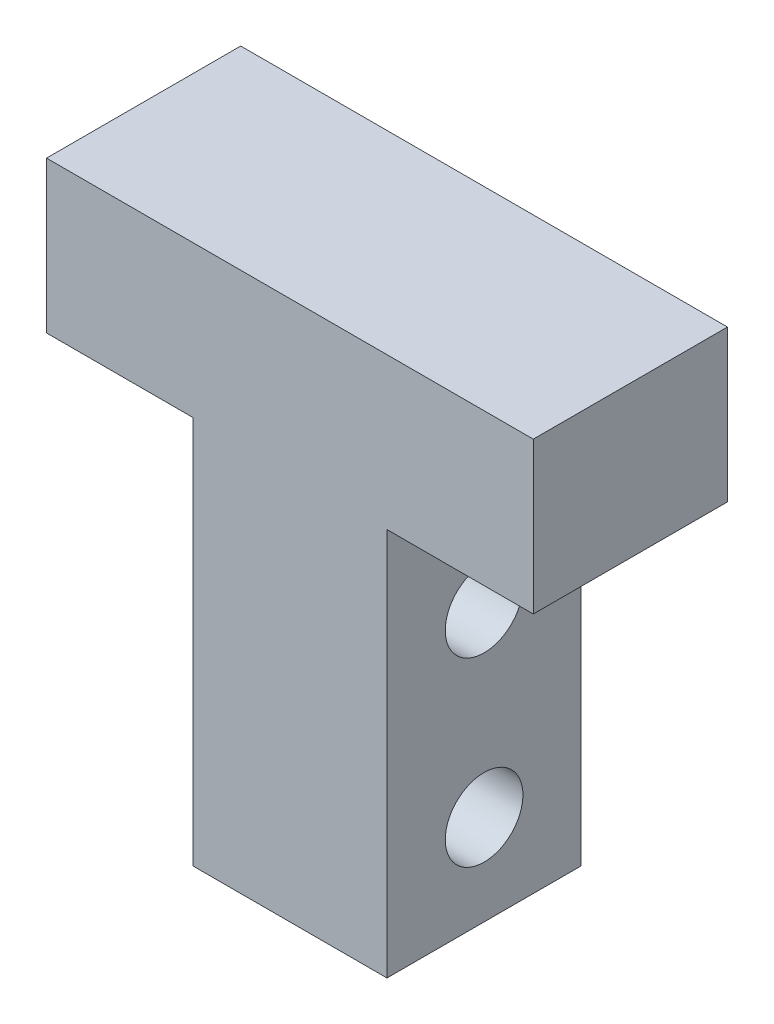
ISO-10303-21;
HEADER;
FILE_DESCRIPTION(('STEP AP214'),'2;1');
FILE_NAME('part.step','',(''),(''),'','','');
FILE_SCHEMA(('AUTOMOTIVE_DESIGN { 1 0 10303 214 1 1 1 1 }'));
ENDSEC;
DATA;
#1=APPLICATION_CONTEXT('core data for automotive mechanical design processes');
#2=APPLICATION_PROTOCOL_DEFINITION('international standard','automotive_design',2000,#1);
#3=PRODUCT_CONTEXT('',#1,'mechanical');
#4=PRODUCT('Part','Part','',(#3));
#5=PRODUCT_RELATED_PRODUCT_CATEGORY('part','',(#4));
#6=PRODUCT_DEFINITION_FORMATION('','',#4);
#7=PRODUCT_DEFINITION_CONTEXT('part definition',#1,'design');
#8=PRODUCT_DEFINITION('design','',#6,#7);
#9=PRODUCT_DEFINITION_SHAPE('','',#8);
#10=(LENGTH_UNIT() NAMED_UNIT(*) SI_UNIT(.MILLI.,.METRE.));
#11=(NAMED_UNIT(*) PLANE_ANGLE_UNIT() SI_UNIT($,.RADIAN.));
#12=(NAMED_UNIT(*) SI_UNIT($,.STERADIAN.) SOLID_ANGLE_UNIT());
#13=UNCERTAINTY_MEASURE_WITH_UNIT(LENGTH_MEASURE(1.E-05),#10,'distance_accuracy_value','');
#14=(GEOMETRIC_REPRESENTATION_CONTEXT(3) GLOBAL_UNCERTAINTY_ASSIGNED_CONTEXT((#13)) GLOBAL_UNIT_ASSIGNED_CONTEXT((#10,
#11,#12)) REPRESENTATION_CONTEXT('',''));
#15=CARTESIAN_POINT('',(0.,0.,0.));
#16=DIRECTION('',(0.,0.,1.));
#17=DIRECTION('',(1.,0.,0.));
#18=AXIS2_PLACEMENT_3D('',#15,#16,#17);
#19=CARTESIAN_POINT('',(-18.8,5.85,15.));
#20=DIRECTION('',(1.,0.,0.));
#21=DIRECTION('',(0.,0.,-1.));
#22=AXIS2_PLACEMENT_3D('',#19,#20,#21);
#23=PLANE('',#22);
#24=DIRECTION('',(0.,-1.,0.));
#25=VECTOR('',#24,1.);
#26=CARTESIAN_POINT('',(-18.8,5.85,0.));
#27=LINE('',#26,#25);
#28=CARTESIAN_POINT('',(-18.8,5.85,0.));
#29=VERTEX_POINT('',#28);
#30=CARTESIAN_POINT('',(-18.8,-5.85,0.));
#31=VERTEX_POINT('',#30);
#32=EDGE_CURVE('E140',#29,#31,#27,.T.);
#33=ORIENTED_EDGE('',*,*,#32,.T.);
#34=DIRECTION('',(0.,0.,-1.));
#35=VECTOR('',#34,1.);
#36=CARTESIAN_POINT('',(-18.8,-5.85,15.));
#37=LINE('',#36,#35);
#38=CARTESIAN_POINT('',(-18.8,-5.85,15.));
#39=VERTEX_POINT('',#38);
#40=EDGE_CURVE('E11',#39,#31,#37,.T.);
#41=ORIENTED_EDGE('',*,*,#40,.F.);
#42=DIRECTION('',(0.,-1.,0.));
#43=VECTOR('',#42,1.);
#44=CARTESIAN_POINT('',(-18.8,5.85,15.));
#45=LINE('',#44,#43);
#46=CARTESIAN_POINT('',(-18.8,5.85,15.));
#47=VERTEX_POINT('',#46);
#48=EDGE_CURVE('E155',#47,#39,#45,.T.);
#49=ORIENTED_EDGE('',*,*,#48,.F.);
#50=DIRECTION('',(0.,0.,-1.));
#51=VECTOR('',#50,1.);
#52=CARTESIAN_POINT('',(-18.8,5.85,15.));
#53=LINE('',#52,#51);
#54=EDGE_CURVE('E135',#47,#29,#53,.T.);
#55=ORIENTED_EDGE('',*,*,#54,.T.);
#56=EDGE_LOOP('',(#33,#41,#49,#55));
#57=FACE_BOUND('',#56,.T.);
#58=ADVANCED_FACE('F41',(#57),#23,.F.);
#59=CARTESIAN_POINT('',(-18.8,-5.85,15.));
#60=DIRECTION('',(0.,1.,0.));
#61=DIRECTION('',(0.,0.,1.));
#62=AXIS2_PLACEMENT_3D('',#59,#60,#61);
#63=PLANE('',#62);
#64=DIRECTION('',(1.,0.,0.));
#65=VECTOR('',#64,1.);
#66=CARTESIAN_POINT('',(-18.8,-5.85,0.));
#67=LINE('',#66,#65);
#68=CARTESIAN_POINT('',(-7.5,-5.85,0.));
#69=VERTEX_POINT('',#68);
#70=EDGE_CURVE('E136',#31,#69,#67,.T.);
#71=ORIENTED_EDGE('',*,*,#70,.T.);
#72=DIRECTION('',(0.,0.,-1.));
#73=VECTOR('',#72,1.);
#74=CARTESIAN_POINT('',(-7.5,-5.85,15.));
#75=LINE('',#74,#73);
#76=CARTESIAN_POINT('',(-7.5,-5.85,15.));
#77=VERTEX_POINT('',#76);
#78=EDGE_CURVE('E47',#77,#69,#75,.T.);
#79=ORIENTED_EDGE('',*,*,#78,.F.);
#80=DIRECTION('',(1.,0.,0.));
#81=VECTOR('',#80,1.);
#82=CARTESIAN_POINT('',(-18.8,-5.85,15.));
#83=LINE('',#82,#81);
#84=EDGE_CURVE('E99',#39,#77,#83,.T.);
#85=ORIENTED_EDGE('',*,*,#84,.F.);
#86=ORIENTED_EDGE('',*,*,#40,.T.);
#87=EDGE_LOOP('',(#71,#79,#85,#86));
#88=FACE_BOUND('',#87,.T.);
#89=ADVANCED_FACE('F215',(#88),#63,.F.);
#90=CARTESIAN_POINT('',(-7.5,-5.85,15.));
#91=DIRECTION('',(1.,0.,0.));
#92=DIRECTION('',(0.,1.,0.));
#93=AXIS2_PLACEMENT_3D('',#90,#91,#92);
#94=PLANE('',#93);
#95=CARTESIAN_POINT('',(-7.5,-28.85,7.5));
#96=DIRECTION('',(1.,0.,0.));
#97=DIRECTION('',(0.,1.,0.));
#98=AXIS2_PLACEMENT_3D('',#95,#96,#97);
#99=CIRCLE('',#98,3.);
#100=CARTESIAN_POINT('',(-7.5,-25.85,7.5));
#101=VERTEX_POINT('',#100);
#102=EDGE_CURVE('E143',#101,#101,#99,.T.);
#103=ORIENTED_EDGE('',*,*,#102,.T.);
#104=EDGE_LOOP('',(#103));
#105=FACE_BOUND('',#104,.T.);
#106=CARTESIAN_POINT('',(-7.5,-14.85,7.5));
#107=DIRECTION('',(1.,0.,0.));
#108=DIRECTION('',(0.,1.,0.));
#109=AXIS2_PLACEMENT_3D('',#106,#107,#108);
#110=CIRCLE('',#109,3.);
#111=CARTESIAN_POINT('',(-7.5,-11.85,7.5));
#112=VERTEX_POINT('',#111);
#113=EDGE_CURVE('E186',#112,#112,#110,.T.);
#114=ORIENTED_EDGE('',*,*,#113,.T.);
#115=EDGE_LOOP('',(#114));
#116=FACE_BOUND('',#115,.T.);
#117=DIRECTION('',(0.,-1.,0.));
#118=VECTOR('',#117,1.);
#119=CARTESIAN_POINT('',(-7.5,-5.85,0.));
#120=LINE('',#119,#118);
#121=CARTESIAN_POINT('',(-7.5,-35.85,0.));
#122=VERTEX_POINT('',#121);
#123=EDGE_CURVE('E141',#69,#122,#120,.T.);
#124=ORIENTED_EDGE('',*,*,#123,.T.);
#125=DIRECTION('',(0.,0.,-1.));
#126=VECTOR('',#125,1.);
#127=CARTESIAN_POINT('',(-7.5,-35.85,15.));
#128=LINE('',#127,#126);
#129=CARTESIAN_POINT('',(-7.5,-35.85,15.));
#130=VERTEX_POINT('',#129);
#131=EDGE_CURVE('E157',#130,#122,#128,.T.);
#132=ORIENTED_EDGE('',*,*,#131,.F.);
#133=DIRECTION('',(0.,-1.,0.));
#134=VECTOR('',#133,1.);
#135=CARTESIAN_POINT('',(-7.5,-5.85,15.));
#136=LINE('',#135,#134);
#137=EDGE_CURVE('E170',#77,#130,#136,.T.);
#138=ORIENTED_EDGE('',*,*,#137,.F.);
#139=ORIENTED_EDGE('',*,*,#78,.T.);
#140=EDGE_LOOP('',(#124,#132,#138,#139));
#141=FACE_BOUND('',#140,.T.);
#142=ADVANCED_FACE('F164',(#105,#116,#141),#94,.F.);
#143=CARTESIAN_POINT('',(-7.5,-35.85,15.));
#144=DIRECTION('',(0.,1.,0.));
#145=DIRECTION('',(0.,0.,1.));
#146=AXIS2_PLACEMENT_3D('',#143,#144,#145);
#147=PLANE('',#146);
#148=DIRECTION('',(1.,0.,0.));
#149=VECTOR('',#148,1.);
#150=CARTESIAN_POINT('',(-7.5,-35.85,0.));
#151=LINE('',#150,#149);
#152=CARTESIAN_POINT('',(7.5,-35.85,0.));
#153=VERTEX_POINT('',#152);
#154=EDGE_CURVE('E144',#122,#153,#151,.T.);
#155=ORIENTED_EDGE('',*,*,#154,.T.);
#156=DIRECTION('',(0.,0.,-1.));
#157=VECTOR('',#156,1.);
#158=CARTESIAN_POINT('',(7.5,-35.85,15.));
#159=LINE('',#158,#157);
#160=CARTESIAN_POINT('',(7.5,-35.85,15.));
#161=VERTEX_POINT('',#160);
#162=EDGE_CURVE('E156',#161,#153,#159,.T.);
#163=ORIENTED_EDGE('',*,*,#162,.F.);
#164=DIRECTION('',(1.,0.,0.));
#165=VECTOR('',#164,1.);
#166=CARTESIAN_POINT('',(-7.5,-35.85,15.));
#167=LINE('',#166,#165);
#168=EDGE_CURVE('E176',#130,#161,#167,.T.);
#169=ORIENTED_EDGE('',*,*,#168,.F.);
#170=ORIENTED_EDGE('',*,*,#131,.T.);
#171=EDGE_LOOP('',(#155,#163,#169,#170));
#172=FACE_BOUND('',#171,.T.);
#173=ADVANCED_FACE('F174',(#172),#147,.F.);
#174=CARTESIAN_POINT('',(7.5,-5.85,15.));
#175=DIRECTION('',(-1.,0.,0.));
#176=DIRECTION('',(0.,-1.,0.));
#177=AXIS2_PLACEMENT_3D('',#174,#175,#176);
#178=PLANE('',#177);
#179=CARTESIAN_POINT('',(7.5,-28.85,7.5));
#180=DIRECTION('',(1.,0.,0.));
#181=DIRECTION('',(0.,1.,0.));
#182=AXIS2_PLACEMENT_3D('',#179,#180,#181);
#183=CIRCLE('',#182,3.);
#184=CARTESIAN_POINT('',(7.5,-25.85,7.5));
#185=VERTEX_POINT('',#184);
#186=EDGE_CURVE('E187',#185,#185,#183,.T.);
#187=ORIENTED_EDGE('',*,*,#186,.F.);
#188=EDGE_LOOP('',(#187));
#189=FACE_BOUND('',#188,.T.);
#190=CARTESIAN_POINT('',(7.5,-14.85,7.5));
#191=DIRECTION('',(1.,0.,0.));
#192=DIRECTION('',(0.,1.,0.));
#193=AXIS2_PLACEMENT_3D('',#190,#191,#192);
#194=CIRCLE('',#193,3.);
#195=CARTESIAN_POINT('',(7.5,-11.85,7.5));
#196=VERTEX_POINT('',#195);
#197=EDGE_CURVE('E192',#196,#196,#194,.T.);
#198=ORIENTED_EDGE('',*,*,#197,.F.);
#199=EDGE_LOOP('',(#198));
#200=FACE_BOUND('',#199,.T.);
#201=DIRECTION('',(0.,1.,0.));
#202=VECTOR('',#201,1.);
#203=CARTESIAN_POINT('',(7.5,-5.85,0.));
#204=LINE('',#203,#202);
#205=CARTESIAN_POINT('',(7.5,-5.85,0.));
#206=VERTEX_POINT('',#205);
#207=EDGE_CURVE('E150',#153,#206,#204,.T.);
#208=ORIENTED_EDGE('',*,*,#207,.T.);
#209=DIRECTION('',(0.,0.,-1.));
#210=VECTOR('',#209,1.);
#211=CARTESIAN_POINT('',(7.5,-5.85,15.));
#212=LINE('',#211,#210);
#213=CARTESIAN_POINT('',(7.5,-5.85,15.));
#214=VERTEX_POINT('',#213);
#215=EDGE_CURVE('E126',#214,#206,#212,.T.);
#216=ORIENTED_EDGE('',*,*,#215,.F.);
#217=DIRECTION('',(0.,1.,0.));
#218=VECTOR('',#217,1.);
#219=CARTESIAN_POINT('',(7.5,-5.85,15.));
#220=LINE('',#219,#218);
#221=EDGE_CURVE('E118',#161,#214,#220,.T.);
#222=ORIENTED_EDGE('',*,*,#221,.F.);
#223=ORIENTED_EDGE('',*,*,#162,.T.);
#224=EDGE_LOOP('',(#208,#216,#222,#223));
#225=FACE_BOUND('',#224,.T.);
#226=ADVANCED_FACE('F179',(#189,#200,#225),#178,.F.);
#227=CARTESIAN_POINT('',(7.5,-5.85,15.));
#228=DIRECTION('',(0.,1.,0.));
#229=DIRECTION('',(0.,0.,1.));
#230=AXIS2_PLACEMENT_3D('',#227,#228,#229);
#231=PLANE('',#230);
#232=DIRECTION('',(1.,0.,0.));
#233=VECTOR('',#232,1.);
#234=CARTESIAN_POINT('',(7.5,-5.85,0.));
#235=LINE('',#234,#233);
#236=CARTESIAN_POINT('',(18.8,-5.85,0.));
#237=VERTEX_POINT('',#236);
#238=EDGE_CURVE('E130',#206,#237,#235,.T.);
#239=ORIENTED_EDGE('',*,*,#238,.T.);
#240=DIRECTION('',(0.,0.,-1.));
#241=VECTOR('',#240,1.);
#242=CARTESIAN_POINT('',(18.8,-5.85,15.));
#243=LINE('',#242,#241);
#244=CARTESIAN_POINT('',(18.8,-5.85,15.));
#245=VERTEX_POINT('',#244);
#246=EDGE_CURVE('E121',#245,#237,#243,.T.);
#247=ORIENTED_EDGE('',*,*,#246,.F.);
#248=DIRECTION('',(1.,0.,0.));
#249=VECTOR('',#248,1.);
#250=CARTESIAN_POINT('',(7.5,-5.85,15.));
#251=LINE('',#250,#249);
#252=EDGE_CURVE('E114',#214,#245,#251,.T.);
#253=ORIENTED_EDGE('',*,*,#252,.F.);
#254=ORIENTED_EDGE('',*,*,#215,.T.);
#255=EDGE_LOOP('',(#239,#247,#253,#254));
#256=FACE_BOUND('',#255,.T.);
#257=ADVANCED_FACE('F123',(#256),#231,.F.);
#258=CARTESIAN_POINT('',(18.8,5.85,15.));
#259=DIRECTION('',(-1.,0.,0.));
#260=DIRECTION('',(0.,0.,1.));
#261=AXIS2_PLACEMENT_3D('',#258,#259,#260);
#262=PLANE('',#261);
#263=DIRECTION('',(0.,1.,0.));
#264=VECTOR('',#263,1.);
#265=CARTESIAN_POINT('',(18.8,5.85,0.));
#266=LINE('',#265,#264);
#267=CARTESIAN_POINT('',(18.8,5.85,0.));
#268=VERTEX_POINT('',#267);
#269=EDGE_CURVE('E88',#237,#268,#266,.T.);
#270=ORIENTED_EDGE('',*,*,#269,.T.);
#271=DIRECTION('',(0.,0.,-1.));
#272=VECTOR('',#271,1.);
#273=CARTESIAN_POINT('',(18.8,5.85,15.));
#274=LINE('',#273,#272);
#275=CARTESIAN_POINT('',(18.8,5.85,15.));
#276=VERTEX_POINT('',#275);
#277=EDGE_CURVE('E129',#276,#268,#274,.T.);
#278=ORIENTED_EDGE('',*,*,#277,.F.);
#279=DIRECTION('',(0.,1.,0.));
#280=VECTOR('',#279,1.);
#281=CARTESIAN_POINT('',(18.8,5.85,15.));
#282=LINE('',#281,#280);
#283=EDGE_CURVE('E120',#245,#276,#282,.T.);
#284=ORIENTED_EDGE('',*,*,#283,.F.);
#285=ORIENTED_EDGE('',*,*,#246,.T.);
#286=EDGE_LOOP('',(#270,#278,#284,#285));
#287=FACE_BOUND('',#286,.T.);
#288=ADVANCED_FACE('F134',(#287),#262,.F.);
#289=CARTESIAN_POINT('',(-18.8,5.85,15.));
#290=DIRECTION('',(0.,-1.,0.));
#291=DIRECTION('',(0.,0.,-1.));
#292=AXIS2_PLACEMENT_3D('',#289,#290,#291);
#293=PLANE('',#292);
#294=DIRECTION('',(-1.,0.,0.));
#295=VECTOR('',#294,1.);
#296=CARTESIAN_POINT('',(-18.8,5.85,0.));
#297=LINE('',#296,#295);
#298=EDGE_CURVE('E95',#268,#29,#297,.T.);
#299=ORIENTED_EDGE('',*,*,#298,.T.);
#300=ORIENTED_EDGE('',*,*,#54,.F.);
#301=DIRECTION('',(-1.,0.,0.));
#302=VECTOR('',#301,1.);
#303=CARTESIAN_POINT('',(-18.8,5.85,15.));
#304=LINE('',#303,#302);
#305=EDGE_CURVE('E60',#276,#47,#304,.T.);
#306=ORIENTED_EDGE('',*,*,#305,.F.);
#307=ORIENTED_EDGE('',*,*,#277,.T.);
#308=EDGE_LOOP('',(#299,#300,#306,#307));
#309=FACE_BOUND('',#308,.T.);
#310=ADVANCED_FACE('F230',(#309),#293,.F.);
#311=CARTESIAN_POINT('',(0.,0.,15.));
#312=DIRECTION('',(0.,0.,1.));
#313=DIRECTION('',(1.,0.,0.));
#314=AXIS2_PLACEMENT_3D('',#311,#312,#313);
#315=PLANE('',#314);
#316=ORIENTED_EDGE('',*,*,#48,.T.);
#317=ORIENTED_EDGE('',*,*,#84,.T.);
#318=ORIENTED_EDGE('',*,*,#137,.T.);
#319=ORIENTED_EDGE('',*,*,#168,.T.);
#320=ORIENTED_EDGE('',*,*,#221,.T.);
#321=ORIENTED_EDGE('',*,*,#252,.T.);
#322=ORIENTED_EDGE('',*,*,#283,.T.);
#323=ORIENTED_EDGE('',*,*,#305,.T.);
#324=EDGE_LOOP('',(#316,#317,#318,#319,#320,#321,#322,#323));
#325=FACE_BOUND('',#324,.T.);
#326=ADVANCED_FACE('F113',(#325),#315,.T.);
#327=CARTESIAN_POINT('',(0.,0.,0.));
#328=DIRECTION('',(0.,0.,1.));
#329=DIRECTION('',(1.,0.,0.));
#330=AXIS2_PLACEMENT_3D('',#327,#328,#329);
#331=PLANE('',#330);
#332=ORIENTED_EDGE('',*,*,#32,.F.);
#333=ORIENTED_EDGE('',*,*,#298,.F.);
#334=ORIENTED_EDGE('',*,*,#269,.F.);
#335=ORIENTED_EDGE('',*,*,#238,.F.);
#336=ORIENTED_EDGE('',*,*,#207,.F.);
#337=ORIENTED_EDGE('',*,*,#154,.F.);
#338=ORIENTED_EDGE('',*,*,#123,.F.);
#339=ORIENTED_EDGE('',*,*,#70,.F.);
#340=EDGE_LOOP('',(#332,#333,#334,#335,#336,#337,#338,#339));
#341=FACE_BOUND('',#340,.T.);
#342=ADVANCED_FACE('F171',(#341),#331,.F.);
#343=CARTESIAN_POINT('',(-18.8,-14.85,7.5));
#344=DIRECTION('',(1.,0.,0.));
#345=DIRECTION('',(0.,1.,0.));
#346=AXIS2_PLACEMENT_3D('',#343,#344,#345);
#347=CYLINDRICAL_SURFACE('',#346,3.);
#348=ORIENTED_EDGE('',*,*,#197,.T.);
#349=EDGE_LOOP('',(#348));
#350=FACE_BOUND('',#349,.T.);
#351=ORIENTED_EDGE('',*,*,#113,.F.);
#352=EDGE_LOOP('',(#351));
#353=FACE_BOUND('',#352,.T.);
#354=ADVANCED_FACE('F202',(#350,#353),#347,.F.);
#355=CARTESIAN_POINT('',(-18.8,-28.85,7.5));
#356=DIRECTION('',(1.,0.,0.));
#357=DIRECTION('',(0.,1.,0.));
#358=AXIS2_PLACEMENT_3D('',#355,#356,#357);
#359=CYLINDRICAL_SURFACE('',#358,3.);
#360=ORIENTED_EDGE('',*,*,#186,.T.);
#361=EDGE_LOOP('',(#360));
#362=FACE_BOUND('',#361,.T.);
#363=ORIENTED_EDGE('',*,*,#102,.F.);
#364=EDGE_LOOP('',(#363));
#365=FACE_BOUND('',#364,.T.);
#366=ADVANCED_FACE('F197',(#362,#365),#359,.F.);
#367=CLOSED_SHELL('',(#58,#89,#142,#173,#226,#257,#288,#310,#326,#342,#354,#366));
#368=MANIFOLD_SOLID_BREP('B2',#367);
#369=ADVANCED_BREP_SHAPE_REPRESENTATION('',(#18,#368),#14);
#370=SHAPE_DEFINITION_REPRESENTATION(#9,#369);
ENDSEC;
END-ISO-10303-21;
